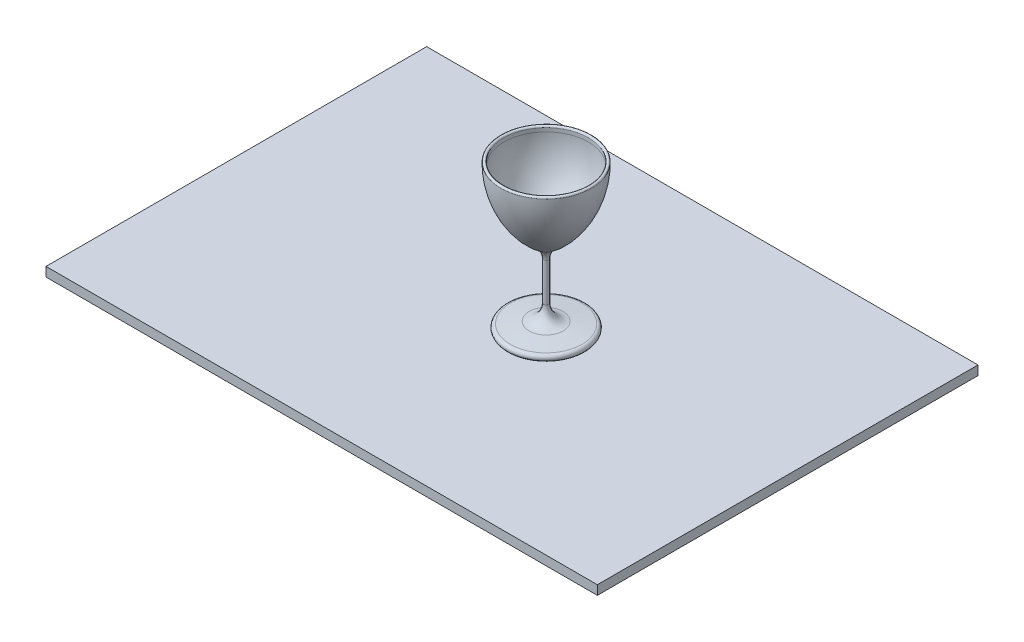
ISO-10303-21;
HEADER;
FILE_DESCRIPTION(('STEP AP214'),'2;1');
FILE_NAME('part.step','',(''),(''),'','','');
FILE_SCHEMA(('AUTOMOTIVE_DESIGN { 1 0 10303 214 1 1 1 1 }'));
ENDSEC;
DATA;
#1=APPLICATION_CONTEXT('core data for automotive mechanical design processes');
#2=APPLICATION_PROTOCOL_DEFINITION('international standard','automotive_design',2000,#1);
#3=PRODUCT_CONTEXT('',#1,'mechanical');
#4=PRODUCT('Part','Part','',(#3));
#5=PRODUCT_RELATED_PRODUCT_CATEGORY('part','',(#4));
#6=PRODUCT_DEFINITION_FORMATION('','',#4);
#7=PRODUCT_DEFINITION_CONTEXT('part definition',#1,'design');
#8=PRODUCT_DEFINITION('design','',#6,#7);
#9=PRODUCT_DEFINITION_SHAPE('','',#8);
#10=(LENGTH_UNIT() NAMED_UNIT(*) SI_UNIT(.MILLI.,.METRE.));
#11=(NAMED_UNIT(*) PLANE_ANGLE_UNIT() SI_UNIT($,.RADIAN.));
#12=(NAMED_UNIT(*) SI_UNIT($,.STERADIAN.) SOLID_ANGLE_UNIT());
#13=UNCERTAINTY_MEASURE_WITH_UNIT(LENGTH_MEASURE(1.E-05),#10,'distance_accuracy_value','');
#14=(GEOMETRIC_REPRESENTATION_CONTEXT(3) GLOBAL_UNCERTAINTY_ASSIGNED_CONTEXT((#13)) GLOBAL_UNIT_ASSIGNED_CONTEXT((#10,
#11,#12)) REPRESENTATION_CONTEXT('',''));
#15=CARTESIAN_POINT('',(0.,0.,0.));
#16=DIRECTION('',(0.,0.,1.));
#17=DIRECTION('',(1.,0.,0.));
#18=AXIS2_PLACEMENT_3D('',#15,#16,#17);
#19=CARTESIAN_POINT('',(-331.244435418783,-10.,-201.991961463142));
#20=DIRECTION('',(-1.,0.,0.));
#21=DIRECTION('',(0.,0.,1.));
#22=AXIS2_PLACEMENT_3D('',#19,#20,#21);
#23=PLANE('',#22);
#24=DIRECTION('',(0.,0.,1.));
#25=VECTOR('',#24,1.);
#26=CARTESIAN_POINT('',(-331.244435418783,0.,-201.991961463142));
#27=LINE('',#26,#25);
#28=CARTESIAN_POINT('',(-331.244435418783,0.,-201.991961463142));
#29=VERTEX_POINT('',#28);
#30=CARTESIAN_POINT('',(-331.244435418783,0.,209.825444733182));
#31=VERTEX_POINT('',#30);
#32=EDGE_CURVE('E110',#29,#31,#27,.T.);
#33=ORIENTED_EDGE('',*,*,#32,.F.);
#34=DIRECTION('',(0.,1.,0.));
#35=VECTOR('',#34,1.);
#36=CARTESIAN_POINT('',(-331.244435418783,-10.,-201.991961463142));
#37=LINE('',#36,#35);
#38=CARTESIAN_POINT('',(-331.244435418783,-10.,-201.991961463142));
#39=VERTEX_POINT('',#38);
#40=EDGE_CURVE('E12',#39,#29,#37,.T.);
#41=ORIENTED_EDGE('',*,*,#40,.F.);
#42=DIRECTION('',(0.,0.,1.));
#43=VECTOR('',#42,1.);
#44=CARTESIAN_POINT('',(-331.244435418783,-10.,-201.991961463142));
#45=LINE('',#44,#43);
#46=CARTESIAN_POINT('',(-331.244435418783,-10.,209.825444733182));
#47=VERTEX_POINT('',#46);
#48=EDGE_CURVE('E104',#39,#47,#45,.T.);
#49=ORIENTED_EDGE('',*,*,#48,.T.);
#50=DIRECTION('',(0.,1.,0.));
#51=VECTOR('',#50,1.);
#52=CARTESIAN_POINT('',(-331.244435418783,-10.,209.825444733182));
#53=LINE('',#52,#51);
#54=EDGE_CURVE('E49',#47,#31,#53,.T.);
#55=ORIENTED_EDGE('',*,*,#54,.T.);
#56=EDGE_LOOP('',(#33,#41,#49,#55));
#57=FACE_BOUND('',#56,.T.);
#58=ADVANCED_FACE('F46',(#57),#23,.T.);
#59=CARTESIAN_POINT('',(-331.244435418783,-10.,-201.991961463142));
#60=DIRECTION('',(0.,0.,-1.));
#61=DIRECTION('',(-1.,0.,0.));
#62=AXIS2_PLACEMENT_3D('',#59,#60,#61);
#63=PLANE('',#62);
#64=DIRECTION('',(-1.,0.,0.));
#65=VECTOR('',#64,1.);
#66=CARTESIAN_POINT('',(-331.244435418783,0.,-201.991961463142));
#67=LINE('',#66,#65);
#68=CARTESIAN_POINT('',(265.219362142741,0.,-201.991961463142));
#69=VERTEX_POINT('',#68);
#70=EDGE_CURVE('E106',#69,#29,#67,.T.);
#71=ORIENTED_EDGE('',*,*,#70,.F.);
#72=DIRECTION('',(0.,1.,0.));
#73=VECTOR('',#72,1.);
#74=CARTESIAN_POINT('',(265.219362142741,-10.,-201.991961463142));
#75=LINE('',#74,#73);
#76=CARTESIAN_POINT('',(265.219362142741,-10.,-201.991961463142));
#77=VERTEX_POINT('',#76);
#78=EDGE_CURVE('E55',#77,#69,#75,.T.);
#79=ORIENTED_EDGE('',*,*,#78,.F.);
#80=DIRECTION('',(-1.,0.,0.));
#81=VECTOR('',#80,1.);
#82=CARTESIAN_POINT('',(-331.244435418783,-10.,-201.991961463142));
#83=LINE('',#82,#81);
#84=EDGE_CURVE('E101',#77,#39,#83,.T.);
#85=ORIENTED_EDGE('',*,*,#84,.T.);
#86=ORIENTED_EDGE('',*,*,#40,.T.);
#87=EDGE_LOOP('',(#71,#79,#85,#86));
#88=FACE_BOUND('',#87,.T.);
#89=ADVANCED_FACE('F120',(#88),#63,.T.);
#90=CARTESIAN_POINT('',(265.219362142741,-10.,-201.991961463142));
#91=DIRECTION('',(1.,0.,0.));
#92=DIRECTION('',(0.,0.,-1.));
#93=AXIS2_PLACEMENT_3D('',#90,#91,#92);
#94=PLANE('',#93);
#95=DIRECTION('',(0.,0.,-1.));
#96=VECTOR('',#95,1.);
#97=CARTESIAN_POINT('',(265.219362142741,0.,-201.991961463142));
#98=LINE('',#97,#96);
#99=CARTESIAN_POINT('',(265.219362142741,0.,209.825444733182));
#100=VERTEX_POINT('',#99);
#101=EDGE_CURVE('E96',#100,#69,#98,.T.);
#102=ORIENTED_EDGE('',*,*,#101,.F.);
#103=DIRECTION('',(0.,1.,0.));
#104=VECTOR('',#103,1.);
#105=CARTESIAN_POINT('',(265.219362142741,-10.,209.825444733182));
#106=LINE('',#105,#104);
#107=CARTESIAN_POINT('',(265.219362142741,-10.,209.825444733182));
#108=VERTEX_POINT('',#107);
#109=EDGE_CURVE('E91',#108,#100,#106,.T.);
#110=ORIENTED_EDGE('',*,*,#109,.F.);
#111=DIRECTION('',(0.,0.,-1.));
#112=VECTOR('',#111,1.);
#113=CARTESIAN_POINT('',(265.219362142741,-10.,-201.991961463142));
#114=LINE('',#113,#112);
#115=EDGE_CURVE('E94',#108,#77,#114,.T.);
#116=ORIENTED_EDGE('',*,*,#115,.T.);
#117=ORIENTED_EDGE('',*,*,#78,.T.);
#118=EDGE_LOOP('',(#102,#110,#116,#117));
#119=FACE_BOUND('',#118,.T.);
#120=ADVANCED_FACE('F93',(#119),#94,.T.);
#121=CARTESIAN_POINT('',(-331.244435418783,-10.,209.825444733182));
#122=DIRECTION('',(0.,0.,1.));
#123=DIRECTION('',(1.,0.,0.));
#124=AXIS2_PLACEMENT_3D('',#121,#122,#123);
#125=PLANE('',#124);
#126=DIRECTION('',(1.,0.,0.));
#127=VECTOR('',#126,1.);
#128=CARTESIAN_POINT('',(-331.244435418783,0.,209.825444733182));
#129=LINE('',#128,#127);
#130=EDGE_CURVE('E113',#31,#100,#129,.T.);
#131=ORIENTED_EDGE('',*,*,#130,.F.);
#132=ORIENTED_EDGE('',*,*,#54,.F.);
#133=DIRECTION('',(1.,0.,0.));
#134=VECTOR('',#133,1.);
#135=CARTESIAN_POINT('',(-331.244435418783,-10.,209.825444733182));
#136=LINE('',#135,#134);
#137=EDGE_CURVE('E100',#47,#108,#136,.T.);
#138=ORIENTED_EDGE('',*,*,#137,.T.);
#139=ORIENTED_EDGE('',*,*,#109,.T.);
#140=EDGE_LOOP('',(#131,#132,#138,#139));
#141=FACE_BOUND('',#140,.T.);
#142=ADVANCED_FACE('F103',(#141),#125,.T.);
#143=CARTESIAN_POINT('',(-331.244435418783,-10.,209.825444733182));
#144=DIRECTION('',(0.,1.,0.));
#145=DIRECTION('',(0.,0.,1.));
#146=AXIS2_PLACEMENT_3D('',#143,#144,#145);
#147=PLANE('',#146);
#148=ORIENTED_EDGE('',*,*,#48,.F.);
#149=ORIENTED_EDGE('',*,*,#84,.F.);
#150=ORIENTED_EDGE('',*,*,#115,.F.);
#151=ORIENTED_EDGE('',*,*,#137,.F.);
#152=EDGE_LOOP('',(#148,#149,#150,#151));
#153=FACE_BOUND('',#152,.T.);
#154=ADVANCED_FACE('F99',(#153),#147,.F.);
#155=CARTESIAN_POINT('',(-331.244435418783,0.,209.825444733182));
#156=DIRECTION('',(0.,1.,0.));
#157=DIRECTION('',(0.,0.,1.));
#158=AXIS2_PLACEMENT_3D('',#155,#156,#157);
#159=PLANE('',#158);
#160=ORIENTED_EDGE('',*,*,#32,.T.);
#161=ORIENTED_EDGE('',*,*,#130,.T.);
#162=ORIENTED_EDGE('',*,*,#101,.T.);
#163=ORIENTED_EDGE('',*,*,#70,.T.);
#164=EDGE_LOOP('',(#160,#161,#162,#163));
#165=FACE_BOUND('',#164,.T.);
#166=ADVANCED_FACE('F119',(#165),#159,.T.);
#167=CLOSED_SHELL('',(#58,#89,#120,#142,#154,#166));
#168=MANIFOLD_SOLID_BREP('B2',#167);
#169=CARTESIAN_POINT('',(0.,0.,0.));
#170=DIRECTION('',(0.,-1.,0.));
#171=DIRECTION('',(0.,0.,-1.));
#172=AXIS2_PLACEMENT_3D('',#169,#170,#171);
#173=PLANE('',#172);
#174=CARTESIAN_POINT('',(0.,0.,0.));
#175=DIRECTION('',(0.,-1.,0.));
#176=DIRECTION('',(0.,0.,-1.));
#177=AXIS2_PLACEMENT_3D('',#174,#175,#176);
#178=CIRCLE('',#177,38.747477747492);
#179=CARTESIAN_POINT('',(0.,0.,-38.747477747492));
#180=VERTEX_POINT('',#179);
#181=EDGE_CURVE('E44',#180,#180,#178,.T.);
#182=ORIENTED_EDGE('',*,*,#181,.T.);
#183=EDGE_LOOP('',(#182));
#184=FACE_BOUND('',#183,.T.);
#185=ADVANCED_FACE('F169',(#184),#173,.T.);
#186=CARTESIAN_POINT('',(0.,3.52083522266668,0.));
#187=DIRECTION('',(0.,-1.,0.));
#188=DIRECTION('',(0.,0.,-1.));
#189=AXIS2_PLACEMENT_3D('',#186,#187,#188);
#190=TOROIDAL_SURFACE('',#189,38.747477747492,3.52083522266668);
#191=CARTESIAN_POINT('',(0.,7.04167044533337,0.));
#192=DIRECTION('',(0.,-1.,0.));
#193=DIRECTION('',(0.,0.,-1.));
#194=AXIS2_PLACEMENT_3D('',#191,#192,#193);
#195=CIRCLE('',#194,38.747477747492);
#196=CARTESIAN_POINT('',(0.,7.04167044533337,-38.747477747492));
#197=VERTEX_POINT('',#196);
#198=EDGE_CURVE('E175',#197,#197,#195,.T.);
#199=ORIENTED_EDGE('',*,*,#198,.T.);
#200=EDGE_LOOP('',(#199));
#201=FACE_BOUND('',#200,.T.);
#202=ORIENTED_EDGE('',*,*,#181,.F.);
#203=EDGE_LOOP('',(#202));
#204=FACE_BOUND('',#203,.T.);
#205=ADVANCED_FACE('F209',(#201,#204),#190,.T.);
#206=CARTESIAN_POINT('',(0.,7.04167044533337,0.));
#207=DIRECTION('',(0.,-1.,0.));
#208=DIRECTION('',(0.,0.,-1.));
#209=AXIS2_PLACEMENT_3D('',#206,#207,#208);
#210=CONICAL_SURFACE('',#209,38.747477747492,1.45796866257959);
#211=CARTESIAN_POINT('',(0.,9.35483381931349,0.));
#212=DIRECTION('',(0.,-1.,0.));
#213=DIRECTION('',(0.,0.,-1.));
#214=AXIS2_PLACEMENT_3D('',#211,#212,#213);
#215=CIRCLE('',#214,18.3328084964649);
#216=CARTESIAN_POINT('',(0.,9.35483381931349,-18.3328084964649));
#217=VERTEX_POINT('',#216);
#218=EDGE_CURVE('E204',#217,#217,#215,.T.);
#219=ORIENTED_EDGE('',*,*,#218,.T.);
#220=EDGE_LOOP('',(#219));
#221=FACE_BOUND('',#220,.T.);
#222=ORIENTED_EDGE('',*,*,#198,.F.);
#223=EDGE_LOOP('',(#222));
#224=FACE_BOUND('',#223,.T.);
#225=ADVANCED_FACE('F212',(#221,#224),#210,.T.);
#226=CARTESIAN_POINT('',(0.,26.6946299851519,0.));
#227=DIRECTION('',(0.,-1.,0.));
#228=DIRECTION('',(0.,0.,-1.));
#229=AXIS2_PLACEMENT_3D('',#226,#227,#228);
#230=TOROIDAL_SURFACE('',#229,20.2975614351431,17.4507531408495);
#231=CARTESIAN_POINT('',(0.,26.6946299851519,0.));
#232=DIRECTION('',(0.,-1.,0.));
#233=DIRECTION('',(0.,0.,-1.));
#234=AXIS2_PLACEMENT_3D('',#231,#232,#233);
#235=CIRCLE('',#234,2.84680829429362);
#236=CARTESIAN_POINT('',(0.,26.6946299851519,-2.84680829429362));
#237=VERTEX_POINT('',#236);
#238=EDGE_CURVE('E201',#237,#237,#235,.T.);
#239=ORIENTED_EDGE('',*,*,#238,.T.);
#240=EDGE_LOOP('',(#239));
#241=FACE_BOUND('',#240,.T.);
#242=ORIENTED_EDGE('',*,*,#218,.F.);
#243=EDGE_LOOP('',(#242));
#244=FACE_BOUND('',#243,.T.);
#245=ADVANCED_FACE('F214',(#241,#244),#230,.F.);
#246=CARTESIAN_POINT('',(0.,0.,0.));
#247=DIRECTION('',(0.,-1.,0.));
#248=DIRECTION('',(0.,0.,-1.));
#249=AXIS2_PLACEMENT_3D('',#246,#247,#248);
#250=CYLINDRICAL_SURFACE('',#249,2.84680829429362);
#251=CARTESIAN_POINT('',(0.,68.3428495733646,0.));
#252=DIRECTION('',(0.,-1.,0.));
#253=DIRECTION('',(0.,0.,-1.));
#254=AXIS2_PLACEMENT_3D('',#251,#252,#253);
#255=CIRCLE('',#254,2.84680829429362);
#256=CARTESIAN_POINT('',(0.,68.3428495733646,-2.84680829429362));
#257=VERTEX_POINT('',#256);
#258=EDGE_CURVE('E198',#257,#257,#255,.T.);
#259=ORIENTED_EDGE('',*,*,#258,.T.);
#260=EDGE_LOOP('',(#259));
#261=FACE_BOUND('',#260,.T.);
#262=ORIENTED_EDGE('',*,*,#238,.F.);
#263=EDGE_LOOP('',(#262));
#264=FACE_BOUND('',#263,.T.);
#265=ADVANCED_FACE('F221',(#261,#264),#250,.T.);
#266=CARTESIAN_POINT('',(0.,68.3428495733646,0.));
#267=DIRECTION('',(0.,-1.,0.));
#268=DIRECTION('',(0.,0.,-1.));
#269=AXIS2_PLACEMENT_3D('',#266,#267,#268);
#270=TOROIDAL_SURFACE('',#269,17.4629743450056,14.616166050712);
#271=CARTESIAN_POINT('',(0.,80.2213026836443,0.));
#272=DIRECTION('',(0.,-1.,0.));
#273=DIRECTION('',(0.,0.,-1.));
#274=AXIS2_PLACEMENT_3D('',#271,#272,#273);
#275=CIRCLE('',#274,8.94624599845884);
#276=CARTESIAN_POINT('',(0.,80.2213026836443,-8.94624599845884));
#277=VERTEX_POINT('',#276);
#278=EDGE_CURVE('E195',#277,#277,#275,.T.);
#279=ORIENTED_EDGE('',*,*,#278,.T.);
#280=EDGE_LOOP('',(#279));
#281=FACE_BOUND('',#280,.T.);
#282=ORIENTED_EDGE('',*,*,#258,.F.);
#283=EDGE_LOOP('',(#282));
#284=FACE_BOUND('',#283,.T.);
#285=ADVANCED_FACE('F252',(#281,#284),#270,.F.);
#286=CARTESIAN_POINT('',(0.,158.385520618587,0.));
#287=DIRECTION('',(0.,-1.,0.));
#288=DIRECTION('',(0.,0.,-1.));
#289=AXIS2_PLACEMENT_3D('',#286,#287,#288);
#290=DEGENERATE_TOROIDAL_SURFACE('',#289,47.0966919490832,96.1792901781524,.F.);
#291=CARTESIAN_POINT('',(0.,158.385520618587,0.));
#292=DIRECTION('',(0.,-1.,0.));
#293=DIRECTION('',(0.,0.,-1.));
#294=AXIS2_PLACEMENT_3D('',#291,#292,#293);
#295=CIRCLE('',#294,49.0825982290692);
#296=CARTESIAN_POINT('',(0.,158.385520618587,-49.0825982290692));
#297=VERTEX_POINT('',#296);
#298=EDGE_CURVE('E190',#297,#297,#295,.T.);
#299=ORIENTED_EDGE('',*,*,#298,.T.);
#300=EDGE_LOOP('',(#299));
#301=FACE_BOUND('',#300,.T.);
#302=ORIENTED_EDGE('',*,*,#278,.F.);
#303=EDGE_LOOP('',(#302));
#304=FACE_BOUND('',#303,.T.);
#305=ADVANCED_FACE('F262',(#301,#304),#290,.F.);
#306=CARTESIAN_POINT('',(0.,158.385520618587,0.));
#307=DIRECTION('',(0.,-1.,0.));
#308=DIRECTION('',(0.,0.,-1.));
#309=AXIS2_PLACEMENT_3D('',#306,#307,#308);
#310=TOROIDAL_SURFACE('',#309,47.3878819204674,1.69471630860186);
#311=CARTESIAN_POINT('',(0.,158.385520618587,0.));
#312=DIRECTION('',(0.,-1.,0.));
#313=DIRECTION('',(0.,0.,-1.));
#314=AXIS2_PLACEMENT_3D('',#311,#312,#313);
#315=CIRCLE('',#314,45.6931656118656);
#316=CARTESIAN_POINT('',(0.,158.385520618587,-45.6931656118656));
#317=VERTEX_POINT('',#316);
#318=EDGE_CURVE('E187',#317,#317,#315,.T.);
#319=ORIENTED_EDGE('',*,*,#318,.T.);
#320=EDGE_LOOP('',(#319));
#321=FACE_BOUND('',#320,.T.);
#322=ORIENTED_EDGE('',*,*,#298,.F.);
#323=EDGE_LOOP('',(#322));
#324=FACE_BOUND('',#323,.T.);
#325=ADVANCED_FACE('F272',(#321,#324),#310,.T.);
#326=CARTESIAN_POINT('',(0.,0.,0.));
#327=DIRECTION('',(0.,-1.,0.));
#328=DIRECTION('',(0.,0.,-1.));
#329=AXIS2_PLACEMENT_3D('',#326,#327,#328);
#330=CYLINDRICAL_SURFACE('',#329,45.6931656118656);
#331=CARTESIAN_POINT('',(0.,154.423811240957,0.));
#332=DIRECTION('',(0.,-1.,0.));
#333=DIRECTION('',(0.,0.,-1.));
#334=AXIS2_PLACEMENT_3D('',#331,#332,#333);
#335=CIRCLE('',#334,45.6931656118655);
#336=CARTESIAN_POINT('',(0.,154.423811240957,-45.6931656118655));
#337=VERTEX_POINT('',#336);
#338=EDGE_CURVE('E185',#337,#337,#335,.T.);
#339=ORIENTED_EDGE('',*,*,#338,.T.);
#340=EDGE_LOOP('',(#339));
#341=FACE_BOUND('',#340,.T.);
#342=ORIENTED_EDGE('',*,*,#318,.F.);
#343=EDGE_LOOP('',(#342));
#344=FACE_BOUND('',#343,.T.);
#345=ADVANCED_FACE('F181',(#341,#344),#330,.F.);
#346=CARTESIAN_POINT('',(0.,154.42257680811,37.4012573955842));
#347=DIRECTION('',(-1.,0.,0.));
#348=DIRECTION('',(0.,0.,-1.));
#349=AXIS2_PLACEMENT_3D('',#346,#347,#348);
#350=CIRCLE('',#349,83.094423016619);
#351=TRIMMED_CURVE('',#350,(PARAMETER_VALUE(-1.10391283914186)),
(PARAMETER_VALUE(1.10391283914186)),.T.,.PARAMETER.);
#352=CARTESIAN_POINT('',(0.,154.42257680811,0.));
#353=DIRECTION('',(0.,-1.,0.));
#354=AXIS1_PLACEMENT('',#352,#353);
#355=SURFACE_OF_REVOLUTION('',#351,#354);
#356=CARTESIAN_POINT('',(0.,80.2213026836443,0.));
#357=VERTEX_POINT('',#356);
#358=VERTEX_LOOP('',#357);
#359=FACE_BOUND('',#358,.T.);
#360=ORIENTED_EDGE('',*,*,#338,.F.);
#361=EDGE_LOOP('',(#360));
#362=FACE_BOUND('',#361,.T.);
#363=ADVANCED_FACE('F178',(#359,#362),#355,.F.);
#364=CLOSED_SHELL('',(#185,#205,#225,#245,#265,#285,#305,#325,#345,#363));
#365=MANIFOLD_SOLID_BREP('B6',#364);
#366=ADVANCED_BREP_SHAPE_REPRESENTATION('',(#18,#168,#365),#14);
#367=SHAPE_DEFINITION_REPRESENTATION(#9,#366);
ENDSEC;
END-ISO-10303-21;
